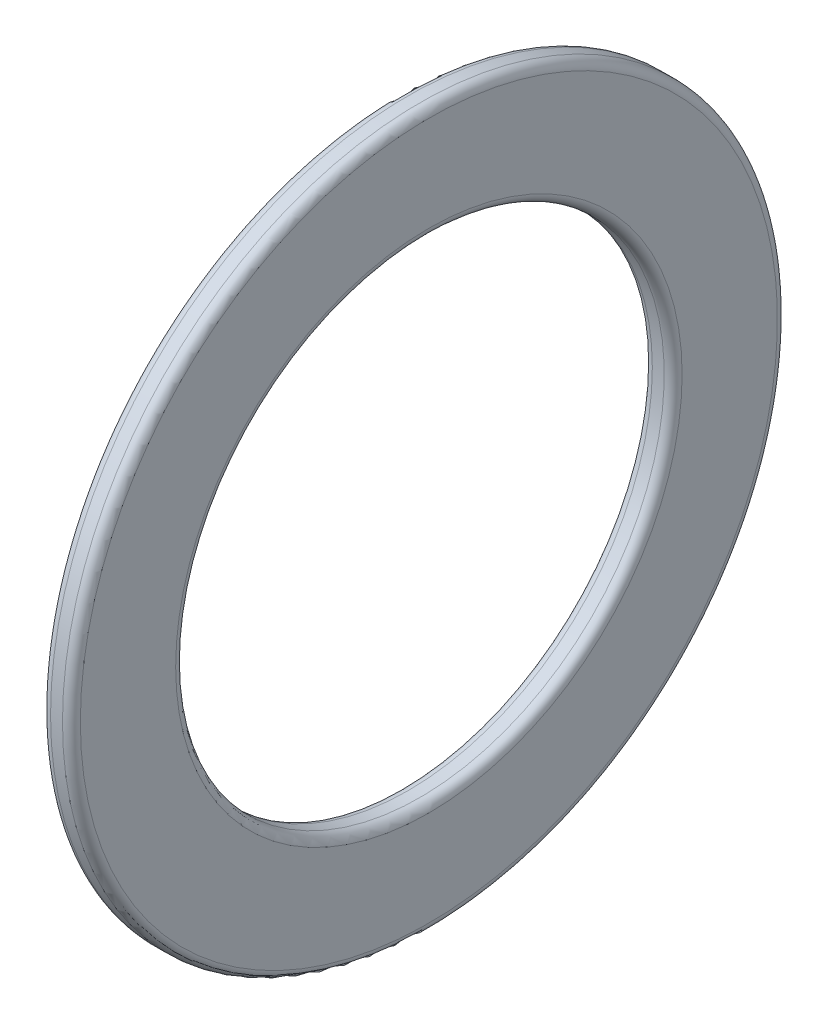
ISO-10303-21;
HEADER;
FILE_DESCRIPTION(('STEP AP214'),'2;1');
FILE_NAME('part.step','',(''),(''),'','','');
FILE_SCHEMA(('AUTOMOTIVE_DESIGN { 1 0 10303 214 1 1 1 1 }'));
ENDSEC;
DATA;
#1=APPLICATION_CONTEXT('core data for automotive mechanical design processes');
#2=APPLICATION_PROTOCOL_DEFINITION('international standard','automotive_design',2000,#1);
#3=PRODUCT_CONTEXT('',#1,'mechanical');
#4=PRODUCT('Part','Part','',(#3));
#5=PRODUCT_RELATED_PRODUCT_CATEGORY('part','',(#4));
#6=PRODUCT_DEFINITION_FORMATION('','',#4);
#7=PRODUCT_DEFINITION_CONTEXT('part definition',#1,'design');
#8=PRODUCT_DEFINITION('design','',#6,#7);
#9=PRODUCT_DEFINITION_SHAPE('','',#8);
#10=(LENGTH_UNIT() NAMED_UNIT(*) SI_UNIT(.MILLI.,.METRE.));
#11=(NAMED_UNIT(*) PLANE_ANGLE_UNIT() SI_UNIT($,.RADIAN.));
#12=(NAMED_UNIT(*) SI_UNIT($,.STERADIAN.) SOLID_ANGLE_UNIT());
#13=UNCERTAINTY_MEASURE_WITH_UNIT(LENGTH_MEASURE(1.E-05),#10,'distance_accuracy_value','');
#14=(GEOMETRIC_REPRESENTATION_CONTEXT(3) GLOBAL_UNCERTAINTY_ASSIGNED_CONTEXT((#13)) GLOBAL_UNIT_ASSIGNED_CONTEXT((#10,
#11,#12)) REPRESENTATION_CONTEXT('',''));
#15=CARTESIAN_POINT('',(0.,0.,0.));
#16=DIRECTION('',(0.,0.,1.));
#17=DIRECTION('',(1.,0.,0.));
#18=AXIS2_PLACEMENT_3D('',#15,#16,#17);
#19=CARTESIAN_POINT('',(-0.999999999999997,12.,0.));
#20=DIRECTION('',(1.,0.,0.));
#21=DIRECTION('',(0.,0.,-1.));
#22=AXIS2_PLACEMENT_3D('',#19,#20,#21);
#23=PLANE('',#22);
#24=CARTESIAN_POINT('',(-0.999999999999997,0.,0.));
#25=DIRECTION('',(1.,0.,0.));
#26=DIRECTION('',(0.,0.,-1.));
#27=AXIS2_PLACEMENT_3D('',#24,#25,#26);
#28=CIRCLE('',#27,11.7);
#29=CARTESIAN_POINT('',(-0.999999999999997,0.,-11.7));
#30=VERTEX_POINT('',#29);
#31=EDGE_CURVE('E364',#30,#30,#28,.F.);
#32=ORIENTED_EDGE('',*,*,#31,.T.);
#33=EDGE_LOOP('',(#32));
#34=FACE_BOUND('',#33,.T.);
#35=CARTESIAN_POINT('',(-0.999999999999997,0.,0.));
#36=DIRECTION('',(1.,0.,0.));
#37=DIRECTION('',(0.,0.,-1.));
#38=AXIS2_PLACEMENT_3D('',#35,#36,#37);
#39=CIRCLE('',#38,8.5);
#40=CARTESIAN_POINT('',(-0.999999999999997,0.,-8.5));
#41=VERTEX_POINT('',#40);
#42=EDGE_CURVE('E368',#41,#41,#39,.T.);
#43=ORIENTED_EDGE('',*,*,#42,.T.);
#44=EDGE_LOOP('',(#43));
#45=FACE_BOUND('',#44,.T.);
#46=ADVANCED_FACE('F354',(#34,#45),#23,.F.);
#47=CARTESIAN_POINT('',(-50.,0.,0.));
#48=DIRECTION('',(-1.,0.,0.));
#49=DIRECTION('',(0.,0.,1.));
#50=AXIS2_PLACEMENT_3D('',#47,#48,#49);
#51=CYLINDRICAL_SURFACE('',#50,8.2);
#52=CARTESIAN_POINT('',(-0.300000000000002,0.,0.));
#53=DIRECTION('',(-1.,0.,0.));
#54=DIRECTION('',(0.,0.,1.));
#55=AXIS2_PLACEMENT_3D('',#52,#53,#54);
#56=CIRCLE('',#55,8.2);
#57=CARTESIAN_POINT('',(-0.300000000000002,0.,8.2));
#58=VERTEX_POINT('',#57);
#59=EDGE_CURVE('E10',#58,#58,#56,.F.);
#60=ORIENTED_EDGE('',*,*,#59,.T.);
#61=EDGE_LOOP('',(#60));
#62=FACE_BOUND('',#61,.T.);
#63=CARTESIAN_POINT('',(-0.699999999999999,0.,0.));
#64=DIRECTION('',(1.,0.,0.));
#65=DIRECTION('',(0.,0.,-1.));
#66=AXIS2_PLACEMENT_3D('',#63,#64,#65);
#67=CIRCLE('',#66,8.2);
#68=CARTESIAN_POINT('',(-0.699999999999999,0.,-8.2));
#69=VERTEX_POINT('',#68);
#70=EDGE_CURVE('E360',#69,#69,#67,.F.);
#71=ORIENTED_EDGE('',*,*,#70,.T.);
#72=EDGE_LOOP('',(#71));
#73=FACE_BOUND('',#72,.T.);
#74=ADVANCED_FACE('F398',(#62,#73),#51,.F.);
#75=CARTESIAN_POINT('',(0.,8.2,0.));
#76=DIRECTION('',(-1.,0.,0.));
#77=DIRECTION('',(0.,0.,1.));
#78=AXIS2_PLACEMENT_3D('',#75,#76,#77);
#79=PLANE('',#78);
#80=CARTESIAN_POINT('',(0.,0.,0.));
#81=DIRECTION('',(-1.,0.,0.));
#82=DIRECTION('',(0.,0.,1.));
#83=AXIS2_PLACEMENT_3D('',#80,#81,#82);
#84=CIRCLE('',#83,11.7);
#85=CARTESIAN_POINT('',(0.,0.,11.7));
#86=VERTEX_POINT('',#85);
#87=EDGE_CURVE('E373',#86,#86,#84,.F.);
#88=ORIENTED_EDGE('',*,*,#87,.T.);
#89=EDGE_LOOP('',(#88));
#90=FACE_BOUND('',#89,.T.);
#91=CARTESIAN_POINT('',(0.,0.,0.));
#92=DIRECTION('',(-1.,0.,0.));
#93=DIRECTION('',(0.,0.,1.));
#94=AXIS2_PLACEMENT_3D('',#91,#92,#93);
#95=CIRCLE('',#94,8.5);
#96=CARTESIAN_POINT('',(0.,0.,8.5));
#97=VERTEX_POINT('',#96);
#98=EDGE_CURVE('E376',#97,#97,#95,.T.);
#99=ORIENTED_EDGE('',*,*,#98,.T.);
#100=EDGE_LOOP('',(#99));
#101=FACE_BOUND('',#100,.T.);
#102=ADVANCED_FACE('F416',(#90,#101),#79,.F.);
#103=CARTESIAN_POINT('',(-50.,0.,0.));
#104=DIRECTION('',(-1.,0.,0.));
#105=DIRECTION('',(0.,0.,1.));
#106=AXIS2_PLACEMENT_3D('',#103,#104,#105);
#107=CYLINDRICAL_SURFACE('',#106,12.);
#108=CARTESIAN_POINT('',(-0.300000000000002,0.,0.));
#109=DIRECTION('',(-1.,0.,0.));
#110=DIRECTION('',(0.,0.,1.));
#111=AXIS2_PLACEMENT_3D('',#108,#109,#110);
#112=CIRCLE('',#111,12.);
#113=CARTESIAN_POINT('',(-0.300000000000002,0.,12.));
#114=VERTEX_POINT('',#113);
#115=EDGE_CURVE('E379',#114,#114,#112,.T.);
#116=ORIENTED_EDGE('',*,*,#115,.T.);
#117=EDGE_LOOP('',(#116));
#118=FACE_BOUND('',#117,.T.);
#119=CARTESIAN_POINT('',(-0.699999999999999,0.,0.));
#120=DIRECTION('',(1.,0.,0.));
#121=DIRECTION('',(0.,0.,-1.));
#122=AXIS2_PLACEMENT_3D('',#119,#120,#121);
#123=CIRCLE('',#122,12.);
#124=CARTESIAN_POINT('',(-0.699999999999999,0.,-12.));
#125=VERTEX_POINT('',#124);
#126=EDGE_CURVE('E382',#125,#125,#123,.T.);
#127=ORIENTED_EDGE('',*,*,#126,.T.);
#128=EDGE_LOOP('',(#127));
#129=FACE_BOUND('',#128,.T.);
#130=ADVANCED_FACE('F386',(#118,#129),#107,.T.);
#131=CARTESIAN_POINT('',(-0.300000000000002,0.,0.));
#132=DIRECTION('',(-1.,0.,0.));
#133=DIRECTION('',(0.,0.,1.));
#134=AXIS2_PLACEMENT_3D('',#131,#132,#133);
#135=TOROIDAL_SURFACE('',#134,11.7,0.3);
#136=ORIENTED_EDGE('',*,*,#87,.F.);
#137=EDGE_LOOP('',(#136));
#138=FACE_BOUND('',#137,.T.);
#139=ORIENTED_EDGE('',*,*,#115,.F.);
#140=EDGE_LOOP('',(#139));
#141=FACE_BOUND('',#140,.T.);
#142=ADVANCED_FACE('F392',(#138,#141),#135,.T.);
#143=CARTESIAN_POINT('',(-0.699999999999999,0.,0.));
#144=DIRECTION('',(1.,0.,0.));
#145=DIRECTION('',(0.,0.,-1.));
#146=AXIS2_PLACEMENT_3D('',#143,#144,#145);
#147=TOROIDAL_SURFACE('',#146,11.7,0.3);
#148=ORIENTED_EDGE('',*,*,#126,.F.);
#149=EDGE_LOOP('',(#148));
#150=FACE_BOUND('',#149,.T.);
#151=ORIENTED_EDGE('',*,*,#31,.F.);
#152=EDGE_LOOP('',(#151));
#153=FACE_BOUND('',#152,.T.);
#154=ADVANCED_FACE('F388',(#150,#153),#147,.T.);
#155=CARTESIAN_POINT('',(-0.300000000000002,0.,0.));
#156=DIRECTION('',(-1.,0.,0.));
#157=DIRECTION('',(0.,0.,1.));
#158=AXIS2_PLACEMENT_3D('',#155,#156,#157);
#159=TOROIDAL_SURFACE('',#158,8.5,0.3);
#160=ORIENTED_EDGE('',*,*,#59,.F.);
#161=EDGE_LOOP('',(#160));
#162=FACE_BOUND('',#161,.T.);
#163=ORIENTED_EDGE('',*,*,#98,.F.);
#164=EDGE_LOOP('',(#163));
#165=FACE_BOUND('',#164,.T.);
#166=ADVANCED_FACE('F391',(#162,#165),#159,.T.);
#167=CARTESIAN_POINT('',(-0.699999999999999,0.,0.));
#168=DIRECTION('',(1.,0.,0.));
#169=DIRECTION('',(0.,0.,-1.));
#170=AXIS2_PLACEMENT_3D('',#167,#168,#169);
#171=TOROIDAL_SURFACE('',#170,8.5,0.3);
#172=ORIENTED_EDGE('',*,*,#42,.F.);
#173=EDGE_LOOP('',(#172));
#174=FACE_BOUND('',#173,.T.);
#175=ORIENTED_EDGE('',*,*,#70,.F.);
#176=EDGE_LOOP('',(#175));
#177=FACE_BOUND('',#176,.T.);
#178=ADVANCED_FACE('F401',(#174,#177),#171,.T.);
#179=CLOSED_SHELL('',(#46,#74,#102,#130,#142,#154,#166,#178));
#180=MANIFOLD_SOLID_BREP('B2',#179);
#181=ADVANCED_BREP_SHAPE_REPRESENTATION('',(#18,#180),#14);
#182=SHAPE_DEFINITION_REPRESENTATION(#9,#181);
ENDSEC;
END-ISO-10303-21;
